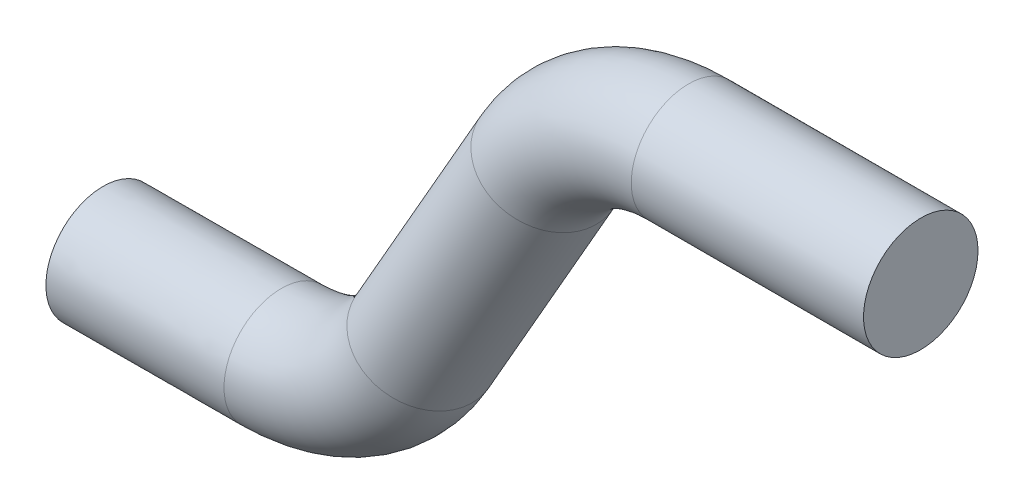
ISO-10303-21;
HEADER;
FILE_DESCRIPTION(('STEP AP214'),'2;1');
FILE_NAME('part.step','',(''),(''),'','','');
FILE_SCHEMA(('AUTOMOTIVE_DESIGN { 1 0 10303 214 1 1 1 1 }'));
ENDSEC;
DATA;
#1=APPLICATION_CONTEXT('core data for automotive mechanical design processes');
#2=APPLICATION_PROTOCOL_DEFINITION('international standard','automotive_design',2000,#1);
#3=PRODUCT_CONTEXT('',#1,'mechanical');
#4=PRODUCT('Part','Part','',(#3));
#5=PRODUCT_RELATED_PRODUCT_CATEGORY('part','',(#4));
#6=PRODUCT_DEFINITION_FORMATION('','',#4);
#7=PRODUCT_DEFINITION_CONTEXT('part definition',#1,'design');
#8=PRODUCT_DEFINITION('design','',#6,#7);
#9=PRODUCT_DEFINITION_SHAPE('','',#8);
#10=(LENGTH_UNIT() NAMED_UNIT(*) SI_UNIT(.MILLI.,.METRE.));
#11=(NAMED_UNIT(*) PLANE_ANGLE_UNIT() SI_UNIT($,.RADIAN.));
#12=(NAMED_UNIT(*) SI_UNIT($,.STERADIAN.) SOLID_ANGLE_UNIT());
#13=UNCERTAINTY_MEASURE_WITH_UNIT(LENGTH_MEASURE(1.E-05),#10,'distance_accuracy_value','');
#14=(GEOMETRIC_REPRESENTATION_CONTEXT(3) GLOBAL_UNCERTAINTY_ASSIGNED_CONTEXT((#13)) GLOBAL_UNIT_ASSIGNED_CONTEXT((#10,
#11,#12)) REPRESENTATION_CONTEXT('',''));
#15=CARTESIAN_POINT('',(0.,0.,0.));
#16=DIRECTION('',(0.,0.,1.));
#17=DIRECTION('',(1.,0.,0.));
#18=AXIS2_PLACEMENT_3D('',#15,#16,#17);
#19=CARTESIAN_POINT('',(53.694917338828,35.,0.));
#20=DIRECTION('',(0.999994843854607,-0.00321127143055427,0.));
#21=DIRECTION('',(0.,0.,-1.));
#22=AXIS2_PLACEMENT_3D('',#19,#20,#21);
#23=CIRCLE('',#22,5.25);
#24=DIRECTION('',(1.,0.,0.));
#25=VECTOR('',#24,1.);
#26=SURFACE_OF_LINEAR_EXTRUSION('',#23,#25);
#27=CARTESIAN_POINT('',(53.694917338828,35.,-5.25));
#28=VERTEX_POINT('',#27);
#29=EDGE_CURVE('E36',#28,#28,#23,.T.);
#30=ORIENTED_EDGE('',*,*,#29,.T.);
#31=EDGE_LOOP('',(#30));
#32=FACE_BOUND('',#31,.T.);
#33=CARTESIAN_POINT('',(75.,35.,0.));
#34=DIRECTION('',(0.999994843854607,-0.00321127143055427,0.));
#35=DIRECTION('',(0.,0.,-1.));
#36=AXIS2_PLACEMENT_3D('',#33,#34,#35);
#37=CIRCLE('',#36,5.25);
#38=CARTESIAN_POINT('',(75.,35.,-5.25));
#39=VERTEX_POINT('',#38);
#40=EDGE_CURVE('E10',#39,#39,#37,.T.);
#41=ORIENTED_EDGE('',*,*,#40,.F.);
#42=EDGE_LOOP('',(#41));
#43=FACE_BOUND('',#42,.T.);
#44=ADVANCED_FACE('F24',(#32,#43),#26,.T.);
#45=CARTESIAN_POINT('',(40.6786427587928,27.4549712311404,0.));
#46=DIRECTION('',(0.499782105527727,0.866151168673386,0.));
#47=DIRECTION('',(0.,0.,-1.));
#48=AXIS2_PLACEMENT_3D('',#45,#46,#47);
#49=CIRCLE('',#48,5.25);
#50=CARTESIAN_POINT('',(53.694917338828,20.,0.));
#51=DIRECTION('',(0.,0.,-1.));
#52=AXIS1_PLACEMENT('',#50,#51);
#53=SURFACE_OF_REVOLUTION('',#49,#52);
#54=CARTESIAN_POINT('',(40.6786427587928,27.4549712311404,-5.25));
#55=VERTEX_POINT('',#54);
#56=EDGE_CURVE('E40',#55,#55,#49,.T.);
#57=ORIENTED_EDGE('',*,*,#56,.T.);
#58=EDGE_LOOP('',(#57));
#59=FACE_BOUND('',#58,.T.);
#60=ORIENTED_EDGE('',*,*,#29,.F.);
#61=EDGE_LOOP('',(#60));
#62=FACE_BOUND('',#61,.T.);
#63=ADVANCED_FACE('F49',(#59,#62),#53,.F.);
#64=CARTESIAN_POINT('',(29.305380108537,7.59741512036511,0.));
#65=DIRECTION('',(0.499782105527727,0.866151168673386,0.));
#66=DIRECTION('',(0.,0.,-1.));
#67=AXIS2_PLACEMENT_3D('',#64,#65,#66);
#68=CIRCLE('',#67,5.25);
#69=DIRECTION('',(0.496998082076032,0.867751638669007,0.));
#70=VECTOR('',#69,1.);
#71=SURFACE_OF_LINEAR_EXTRUSION('',#68,#70);
#72=CARTESIAN_POINT('',(29.305380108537,7.59741512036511,-5.25));
#73=VERTEX_POINT('',#72);
#74=EDGE_CURVE('E46',#73,#73,#68,.T.);
#75=ORIENTED_EDGE('',*,*,#74,.T.);
#76=EDGE_LOOP('',(#75));
#77=FACE_BOUND('',#76,.T.);
#78=ORIENTED_EDGE('',*,*,#56,.F.);
#79=EDGE_LOOP('',(#78));
#80=FACE_BOUND('',#79,.T.);
#81=ADVANCED_FACE('F52',(#77,#80),#71,.T.);
#82=CARTESIAN_POINT('',(16.3372745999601,0.052463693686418,0.));
#83=DIRECTION('',(1.,0.,0.));
#84=DIRECTION('',(0.,0.,-1.));
#85=AXIS2_PLACEMENT_3D('',#82,#83,#84);
#86=CIRCLE('',#85,5.25);
#87=CARTESIAN_POINT('',(16.2891055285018,15.0523863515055,0.));
#88=DIRECTION('',(0.,0.,1.));
#89=AXIS1_PLACEMENT('',#87,#88);
#90=SURFACE_OF_REVOLUTION('',#86,#89);
#91=CARTESIAN_POINT('',(16.3372745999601,0.052463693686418,-5.25));
#92=VERTEX_POINT('',#91);
#93=EDGE_CURVE('E63',#92,#92,#86,.T.);
#94=ORIENTED_EDGE('',*,*,#93,.T.);
#95=EDGE_LOOP('',(#94));
#96=FACE_BOUND('',#95,.T.);
#97=ORIENTED_EDGE('',*,*,#74,.F.);
#98=EDGE_LOOP('',(#97));
#99=FACE_BOUND('',#98,.T.);
#100=ADVANCED_FACE('F56',(#96,#99),#90,.F.);
#101=DIRECTION('',(-0.999994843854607,-0.00321127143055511,0.));
#102=VECTOR('',#101,1.);
#103=SURFACE_OF_LINEAR_EXTRUSION('',#86,#102);
#104=CARTESIAN_POINT('',(8.,-5.12819172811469,1.));
#105=CARTESIAN_POINT('',(8.05559977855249,-5.1280142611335,0.999997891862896));
#106=CARTESIAN_POINT('',(8.11122959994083,-5.12874401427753,0.99534728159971));
#107=CARTESIAN_POINT('',(8.2209254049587,-5.13192305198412,0.976878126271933));
#108=CARTESIAN_POINT('',(8.27499005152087,-5.13437376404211,0.963051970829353));
#109=CARTESIAN_POINT('',(8.37994685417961,-5.14069230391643,0.926672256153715));
#110=CARTESIAN_POINT('',(8.43084221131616,-5.14455867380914,0.904127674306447));
#111=CARTESIAN_POINT('',(8.52813768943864,-5.15325832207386,0.850967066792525));
#112=CARTESIAN_POINT('',(8.57453723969,-5.15809172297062,0.820350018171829));
#113=CARTESIAN_POINT('',(8.66209501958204,-5.16823549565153,0.751509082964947));
#114=CARTESIAN_POINT('',(8.70318886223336,-5.173550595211,0.713203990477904));
#115=CARTESIAN_POINT('',(8.77840908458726,-5.18401022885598,0.630249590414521));
#116=CARTESIAN_POINT('',(8.81253499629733,-5.18915475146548,0.585599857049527));
#117=CARTESIAN_POINT('',(8.87311393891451,-5.19873497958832,0.490777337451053));
#118=CARTESIAN_POINT('',(8.89950254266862,-5.2031646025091,0.440562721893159));
#119=CARTESIAN_POINT('',(8.94344575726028,-5.21075703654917,0.336316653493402));
#120=CARTESIAN_POINT('',(8.96100108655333,-5.2139199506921,0.282285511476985));
#121=CARTESIAN_POINT('',(8.98658316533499,-5.21858743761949,0.172594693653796));
#122=CARTESIAN_POINT('',(8.99471646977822,-5.22011054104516,0.11696067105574));
#123=CARTESIAN_POINT('',(9.00155545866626,-5.22138877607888,0.00509828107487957));
#124=CARTESIAN_POINT('',(9.00026194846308,-5.22114405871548,-0.0511300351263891));
#125=CARTESIAN_POINT('',(8.98836698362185,-5.21892928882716,-0.161838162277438));
#126=CARTESIAN_POINT('',(8.97788277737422,-5.21698097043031,-0.216331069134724));
#127=CARTESIAN_POINT('',(8.94808961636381,-5.21160489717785,-0.322770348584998));
#128=CARTESIAN_POINT('',(8.928780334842,-5.20817708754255,-0.374716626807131));
#129=CARTESIAN_POINT('',(8.88177397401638,-5.2001957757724,-0.474926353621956));
#130=CARTESIAN_POINT('',(8.85403028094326,-5.19563604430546,-0.523167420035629));
#131=CARTESIAN_POINT('',(8.79097618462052,-5.18590205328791,-0.614353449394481));
#132=CARTESIAN_POINT('',(8.75566500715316,-5.18072773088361,-0.65729786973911));
#133=CARTESIAN_POINT('',(8.67783598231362,-5.17025348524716,-0.737361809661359));
#134=CARTESIAN_POINT('',(8.63521614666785,-5.16495285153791,-0.77438216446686));
#135=CARTESIAN_POINT('',(8.54431831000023,-5.15491131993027,-0.840764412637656));
#136=CARTESIAN_POINT('',(8.49604024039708,-5.15017042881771,-0.870126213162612));
#137=CARTESIAN_POINT('',(8.39508221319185,-5.14179914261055,-0.920376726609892));
#138=CARTESIAN_POINT('',(8.34239633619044,-5.13817027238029,-0.941253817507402));
#139=CARTESIAN_POINT('',(8.23418106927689,-5.13247481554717,-0.973833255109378));
#140=CARTESIAN_POINT('',(8.17865201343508,-5.13040804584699,-0.985536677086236));
#141=CARTESIAN_POINT('',(8.06724726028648,-5.12811835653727,-0.999289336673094));
#142=CARTESIAN_POINT('',(8.01139020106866,-5.12786741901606,-1.00148506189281));
#143=CARTESIAN_POINT('',(7.9001127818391,-5.12918011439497,-0.996556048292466));
#144=CARTESIAN_POINT('',(7.84469240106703,-5.13074366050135,-0.989431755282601));
#145=CARTESIAN_POINT('',(7.73631648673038,-5.13549737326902,-0.966187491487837));
#146=CARTESIAN_POINT('',(7.68334472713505,-5.13867437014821,-0.950140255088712));
#147=CARTESIAN_POINT('',(7.58084390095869,-5.14630126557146,-0.909585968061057));
#148=CARTESIAN_POINT('',(7.53131510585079,-5.15075126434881,-0.885078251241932));
#149=CARTESIAN_POINT('',(7.43643306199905,-5.16050455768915,-0.827947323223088));
#150=CARTESIAN_POINT('',(7.39113898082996,-5.16581771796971,-0.795227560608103));
#151=CARTESIAN_POINT('',(7.30663174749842,-5.17668037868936,-0.722731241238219));
#152=CARTESIAN_POINT('',(7.26741916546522,-5.18222990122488,-0.682954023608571));
#153=CARTESIAN_POINT('',(7.19563609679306,-5.19304271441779,-0.596812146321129));
#154=CARTESIAN_POINT('',(7.16316476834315,-5.19830099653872,-0.550364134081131));
#155=CARTESIAN_POINT('',(7.10648844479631,-5.20786527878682,-0.452581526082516));
#156=CARTESIAN_POINT('',(7.08228309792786,-5.21217131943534,-0.40124713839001));
#157=CARTESIAN_POINT('',(7.04298544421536,-5.21932945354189,-0.295446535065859));
#158=CARTESIAN_POINT('',(7.02784051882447,-5.2221899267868,-0.241000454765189));
#159=CARTESIAN_POINT('',(7.00692328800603,-5.22617422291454,-0.13027667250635));
#160=CARTESIAN_POINT('',(7.00114992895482,-5.22729824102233,-0.0739991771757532));
#161=CARTESIAN_POINT('',(6.99917732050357,-5.22768034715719,0.0378091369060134));
#162=CARTESIAN_POINT('',(7.00282366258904,-5.22696852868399,0.0933371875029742));
#163=CARTESIAN_POINT('',(7.01924812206,-5.2238207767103,0.202973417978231));
#164=CARTESIAN_POINT('',(7.0320261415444,-5.22138486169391,0.257081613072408));
#165=CARTESIAN_POINT('',(7.06628533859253,-5.21505973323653,0.362257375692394));
#166=CARTESIAN_POINT('',(7.08774964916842,-5.21117333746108,0.413330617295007));
#167=CARTESIAN_POINT('',(7.13875291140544,-5.20236175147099,0.511172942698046));
#168=CARTESIAN_POINT('',(7.16829244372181,-5.19743648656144,0.55794171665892));
#169=CARTESIAN_POINT('',(7.23513791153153,-5.18698751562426,0.646618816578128));
#170=CARTESIAN_POINT('',(7.27255562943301,-5.1814558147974,0.688441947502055));
#171=CARTESIAN_POINT('',(7.35385325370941,-5.17045684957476,0.765259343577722));
#172=CARTESIAN_POINT('',(7.39773325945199,-5.16498958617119,0.800253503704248));
#173=CARTESIAN_POINT('',(7.49125396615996,-5.15466348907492,0.862771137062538));
#174=CARTESIAN_POINT('',(7.54094917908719,-5.14981147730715,0.890214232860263));
#175=CARTESIAN_POINT('',(7.64432196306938,-5.14133638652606,0.936317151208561));
#176=CARTESIAN_POINT('',(7.69799576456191,-5.13771216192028,0.954985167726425));
#177=CARTESIAN_POINT('',(7.79318013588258,-5.13284618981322,0.979264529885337));
#178=CARTESIAN_POINT('',(7.83413637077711,-5.13122736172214,0.987026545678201));
#179=CARTESIAN_POINT('',(7.91672279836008,-5.12896661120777,0.997394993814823));
#180=CARTESIAN_POINT('',(7.95835297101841,-5.12832465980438,1.00000157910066));
#181=CARTESIAN_POINT('',(8.,-5.12819172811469,1.));
#182=B_SPLINE_CURVE_WITH_KNOTS('',3,(#104,#105,#106,#107,#108,#109,#110,#111,#112,#113,#114,
#115,#116,#117,#118,#119,#120,#121,#122,#123,#124,#125,#126,#127,#128,#129,#130,#131,#132,#133,
#134,#135,#136,#137,#138,#139,#140,#141,#142,#143,#144,#145,#146,#147,#148,#149,#150,#151,#152,
#153,#154,#155,#156,#157,#158,#159,#160,#161,#162,#163,#164,#165,#166,#167,#168,#169,#170,#171,
#172,#173,#174,#175,#176,#177,#178,#179,#180,#181),.UNSPECIFIED.,.T.,.F.,(4,2,2,2,2,2,2,2,2,2,2,
2,2,2,2,2,2,2,2,2,2,2,2,2,2,2,2,2,2,2,2,2,2,2,2,2,2,2,4),(0.,0.166647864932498,
0.333434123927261,0.500049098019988,0.666685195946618,0.835184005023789,1.00369412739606,
1.17356995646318,1.34343196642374,1.51135362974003,1.67926094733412,1.84505689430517,
2.01085898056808,2.17759458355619,2.34434725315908,2.51365102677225,2.6829568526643,
2.8524938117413,3.02201089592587,3.18890667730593,3.35579447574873,3.52134143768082,
3.68690143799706,3.85450749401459,4.02212925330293,4.19206483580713,4.36199318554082,
4.5309248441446,4.6998375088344,4.86599897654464,5.03215866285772,5.19799723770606,
5.36384774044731,5.5322326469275,5.70062014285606,5.87073620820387,6.04069310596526,
6.16552443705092,6.29035206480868),.UNSPECIFIED.);
#183=CARTESIAN_POINT('',(8.,-5.12819172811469,1.));
#184=VERTEX_POINT('',#183);
#185=EDGE_CURVE('E28',#184,#184,#182,.T.);
#186=ORIENTED_EDGE('',*,*,#185,.T.);
#187=EDGE_LOOP('',(#186));
#188=FACE_BOUND('',#187,.T.);
#189=ORIENTED_EDGE('',*,*,#93,.F.);
#190=EDGE_LOOP('',(#189));
#191=FACE_BOUND('',#190,.T.);
#192=CARTESIAN_POINT('',(0.,0.,0.));
#193=DIRECTION('',(1.,0.,0.));
#194=DIRECTION('',(0.,0.,-1.));
#195=AXIS2_PLACEMENT_3D('',#192,#193,#194);
#196=CIRCLE('',#195,5.25);
#197=CARTESIAN_POINT('',(0.,0.,-5.25));
#198=VERTEX_POINT('',#197);
#199=EDGE_CURVE('E67',#198,#198,#196,.T.);
#200=ORIENTED_EDGE('',*,*,#199,.T.);
#201=EDGE_LOOP('',(#200));
#202=FACE_BOUND('',#201,.T.);
#203=ADVANCED_FACE('F59',(#188,#191,#202),#103,.F.);
#204=CARTESIAN_POINT('',(75.,35.,0.));
#205=DIRECTION('',(0.999994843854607,-0.00321127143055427,0.));
#206=DIRECTION('',(0.,0.,-1.));
#207=AXIS2_PLACEMENT_3D('',#204,#205,#206);
#208=PLANE('',#207);
#209=ORIENTED_EDGE('',*,*,#40,.T.);
#210=EDGE_LOOP('',(#209));
#211=FACE_BOUND('',#210,.T.);
#212=ADVANCED_FACE('F91',(#211),#208,.T.);
#213=CARTESIAN_POINT('',(0.,0.,0.));
#214=DIRECTION('',(1.,0.,0.));
#215=DIRECTION('',(0.,0.,-1.));
#216=AXIS2_PLACEMENT_3D('',#213,#214,#215);
#217=PLANE('',#216);
#218=ORIENTED_EDGE('',*,*,#199,.F.);
#219=EDGE_LOOP('',(#218));
#220=FACE_BOUND('',#219,.T.);
#221=ADVANCED_FACE('F83',(#220),#217,.F.);
#222=CARTESIAN_POINT('',(8.,-10.,0.));
#223=DIRECTION('',(0.,1.,0.));
#224=DIRECTION('',(0.,0.,1.));
#225=AXIS2_PLACEMENT_3D('',#222,#223,#224);
#226=CYLINDRICAL_SURFACE('',#225,1.);
#227=CARTESIAN_POINT('',(8.,0.,0.));
#228=DIRECTION('',(0.,1.,0.));
#229=DIRECTION('',(0.,0.,1.));
#230=AXIS2_PLACEMENT_3D('',#227,#228,#229);
#231=CIRCLE('',#230,1.);
#232=CARTESIAN_POINT('',(8.,0.,1.));
#233=VERTEX_POINT('',#232);
#234=EDGE_CURVE('E71',#233,#233,#231,.T.);
#235=ORIENTED_EDGE('',*,*,#234,.T.);
#236=EDGE_LOOP('',(#235));
#237=FACE_BOUND('',#236,.T.);
#238=ORIENTED_EDGE('',*,*,#185,.F.);
#239=EDGE_LOOP('',(#238));
#240=FACE_BOUND('',#239,.T.);
#241=ADVANCED_FACE('F80',(#237,#240),#226,.F.);
#242=CARTESIAN_POINT('',(8.,0.,0.));
#243=DIRECTION('',(0.,1.,0.));
#244=DIRECTION('',(0.,0.,1.));
#245=AXIS2_PLACEMENT_3D('',#242,#243,#244);
#246=PLANE('',#245);
#247=ORIENTED_EDGE('',*,*,#234,.F.);
#248=EDGE_LOOP('',(#247));
#249=FACE_BOUND('',#248,.T.);
#250=ADVANCED_FACE('F82',(#249),#246,.F.);
#251=CLOSED_SHELL('',(#44,#63,#81,#100,#203,#212,#221,#241,#250));
#252=MANIFOLD_SOLID_BREP('B2',#251);
#253=ADVANCED_BREP_SHAPE_REPRESENTATION('',(#18,#252),#14);
#254=SHAPE_DEFINITION_REPRESENTATION(#9,#253);
ENDSEC;
END-ISO-10303-21;
